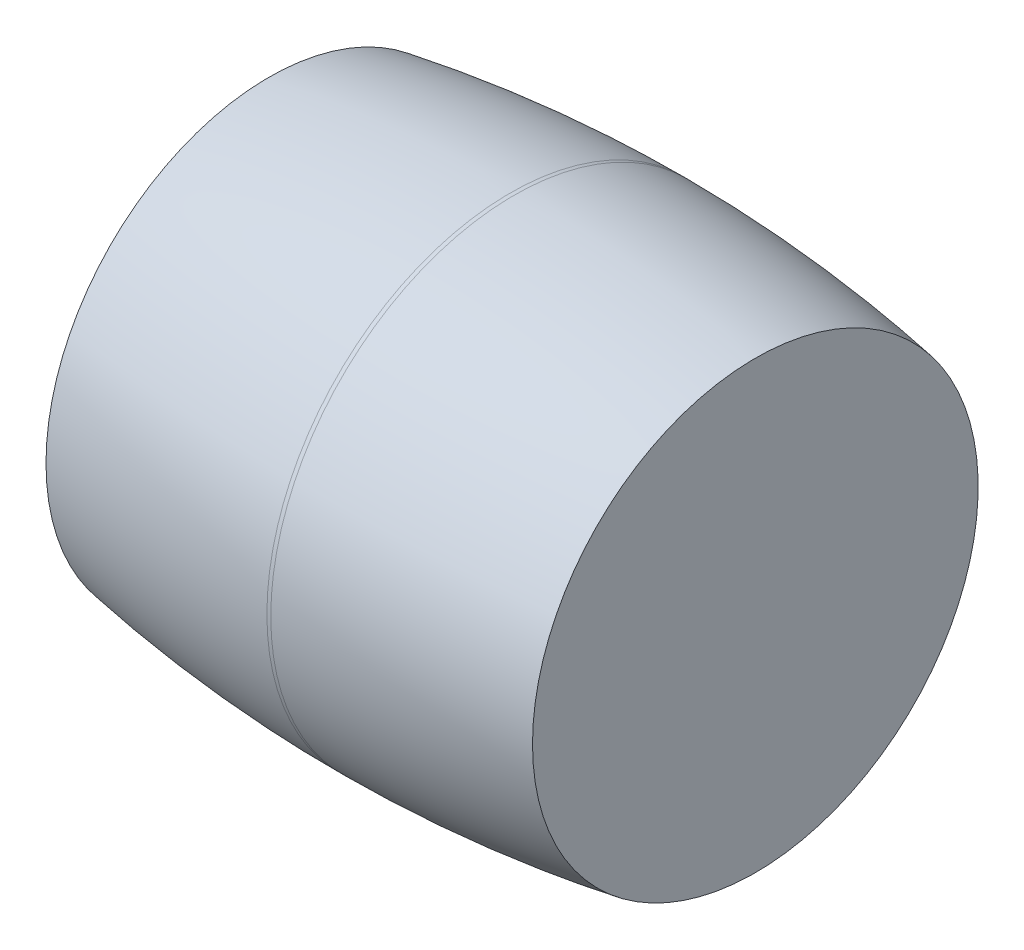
ISO-10303-21;
HEADER;
FILE_DESCRIPTION(('STEP AP214'),'2;1');
FILE_NAME('part.step','',(''),(''),'','','');
FILE_SCHEMA(('AUTOMOTIVE_DESIGN { 1 0 10303 214 1 1 1 1 }'));
ENDSEC;
DATA;
#1=APPLICATION_CONTEXT('core data for automotive mechanical design processes');
#2=APPLICATION_PROTOCOL_DEFINITION('international standard','automotive_design',2000,#1);
#3=PRODUCT_CONTEXT('',#1,'mechanical');
#4=PRODUCT('Part','Part','',(#3));
#5=PRODUCT_RELATED_PRODUCT_CATEGORY('part','',(#4));
#6=PRODUCT_DEFINITION_FORMATION('','',#4);
#7=PRODUCT_DEFINITION_CONTEXT('part definition',#1,'design');
#8=PRODUCT_DEFINITION('design','',#6,#7);
#9=PRODUCT_DEFINITION_SHAPE('','',#8);
#10=(LENGTH_UNIT() NAMED_UNIT(*) SI_UNIT(.MILLI.,.METRE.));
#11=(NAMED_UNIT(*) PLANE_ANGLE_UNIT() SI_UNIT($,.RADIAN.));
#12=(NAMED_UNIT(*) SI_UNIT($,.STERADIAN.) SOLID_ANGLE_UNIT());
#13=UNCERTAINTY_MEASURE_WITH_UNIT(LENGTH_MEASURE(1.E-05),#10,'distance_accuracy_value','');
#14=(GEOMETRIC_REPRESENTATION_CONTEXT(3) GLOBAL_UNCERTAINTY_ASSIGNED_CONTEXT((#13)) GLOBAL_UNIT_ASSIGNED_CONTEXT((#10,
#11,#12)) REPRESENTATION_CONTEXT('',''));
#15=CARTESIAN_POINT('',(0.,0.,0.));
#16=DIRECTION('',(0.,0.,1.));
#17=DIRECTION('',(1.,0.,0.));
#18=AXIS2_PLACEMENT_3D('',#15,#16,#17);
#19=CARTESIAN_POINT('',(-3.175,0.,0.));
#20=DIRECTION('',(1.,0.,0.));
#21=DIRECTION('',(0.,0.,-1.));
#22=AXIS2_PLACEMENT_3D('',#19,#20,#21);
#23=PLANE('',#22);
#24=CARTESIAN_POINT('',(-3.175,0.,0.));
#25=DIRECTION('',(-1.,0.,0.));
#26=DIRECTION('',(0.,0.,1.));
#27=AXIS2_PLACEMENT_3D('',#24,#25,#26);
#28=CIRCLE('',#27,2.90857024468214);
#29=CARTESIAN_POINT('',(-3.175,0.,2.90857024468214));
#30=VERTEX_POINT('',#29);
#31=EDGE_CURVE('E10',#30,#30,#28,.T.);
#32=ORIENTED_EDGE('',*,*,#31,.T.);
#33=EDGE_LOOP('',(#32));
#34=FACE_BOUND('',#33,.T.);
#35=ADVANCED_FACE('F29',(#34),#23,.F.);
#36=CARTESIAN_POINT('',(0.,0.,0.));
#37=DIRECTION('',(-1.,0.,0.));
#38=DIRECTION('',(0.,0.,1.));
#39=AXIS2_PLACEMENT_3D('',#36,#37,#38);
#40=DEGENERATE_TOROIDAL_SURFACE('',#39,15.8749830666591,19.05,.F.);
#41=ORIENTED_EDGE('',*,*,#31,.F.);
#42=EDGE_LOOP('',(#41));
#43=FACE_BOUND('',#42,.T.);
#44=CARTESIAN_POINT('',(-0.0254000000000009,0.,0.));
#45=DIRECTION('',(-1.,0.,0.));
#46=DIRECTION('',(0.,0.,1.));
#47=AXIS2_PLACEMENT_3D('',#44,#45,#46);
#48=CIRCLE('',#47,3.175);
#49=CARTESIAN_POINT('',(-0.0254000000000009,0.,3.175));
#50=VERTEX_POINT('',#49);
#51=EDGE_CURVE('E35',#50,#50,#48,.T.);
#52=ORIENTED_EDGE('',*,*,#51,.T.);
#53=EDGE_LOOP('',(#52));
#54=FACE_BOUND('',#53,.T.);
#55=ADVANCED_FACE('F61',(#43,#54),#40,.F.);
#56=CARTESIAN_POINT('',(0.,0.,0.));
#57=DIRECTION('',(-1.,0.,0.));
#58=DIRECTION('',(0.,0.,1.));
#59=AXIS2_PLACEMENT_3D('',#56,#57,#58);
#60=CYLINDRICAL_SURFACE('',#59,3.175);
#61=ORIENTED_EDGE('',*,*,#51,.F.);
#62=EDGE_LOOP('',(#61));
#63=FACE_BOUND('',#62,.T.);
#64=CARTESIAN_POINT('',(0.0253999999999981,0.,0.));
#65=DIRECTION('',(-1.,0.,0.));
#66=DIRECTION('',(0.,0.,1.));
#67=AXIS2_PLACEMENT_3D('',#64,#65,#66);
#68=CIRCLE('',#67,3.175);
#69=CARTESIAN_POINT('',(0.0253999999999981,0.,3.175));
#70=VERTEX_POINT('',#69);
#71=EDGE_CURVE('E39',#70,#70,#68,.T.);
#72=ORIENTED_EDGE('',*,*,#71,.T.);
#73=EDGE_LOOP('',(#72));
#74=FACE_BOUND('',#73,.T.);
#75=ADVANCED_FACE('F57',(#63,#74),#60,.T.);
#76=CARTESIAN_POINT('',(0.,0.,0.));
#77=DIRECTION('',(-1.,0.,0.));
#78=DIRECTION('',(0.,0.,1.));
#79=AXIS2_PLACEMENT_3D('',#76,#77,#78);
#80=DEGENERATE_TOROIDAL_SURFACE('',#79,15.8749830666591,19.05,.F.);
#81=ORIENTED_EDGE('',*,*,#71,.F.);
#82=EDGE_LOOP('',(#81));
#83=FACE_BOUND('',#82,.T.);
#84=CARTESIAN_POINT('',(3.175,0.,0.));
#85=DIRECTION('',(-1.,0.,0.));
#86=DIRECTION('',(0.,0.,1.));
#87=AXIS2_PLACEMENT_3D('',#84,#85,#86);
#88=CIRCLE('',#87,2.90857024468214);
#89=CARTESIAN_POINT('',(3.175,0.,2.90857024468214));
#90=VERTEX_POINT('',#89);
#91=EDGE_CURVE('E43',#90,#90,#88,.T.);
#92=ORIENTED_EDGE('',*,*,#91,.T.);
#93=EDGE_LOOP('',(#92));
#94=FACE_BOUND('',#93,.T.);
#95=ADVANCED_FACE('F49',(#83,#94),#80,.F.);
#96=CARTESIAN_POINT('',(3.175,0.,0.));
#97=DIRECTION('',(-1.,0.,0.));
#98=DIRECTION('',(0.,0.,1.));
#99=AXIS2_PLACEMENT_3D('',#96,#97,#98);
#100=PLANE('',#99);
#101=ORIENTED_EDGE('',*,*,#91,.F.);
#102=EDGE_LOOP('',(#101));
#103=FACE_BOUND('',#102,.T.);
#104=ADVANCED_FACE('F51',(#103),#100,.F.);
#105=CLOSED_SHELL('',(#35,#55,#75,#95,#104));
#106=MANIFOLD_SOLID_BREP('B2',#105);
#107=ADVANCED_BREP_SHAPE_REPRESENTATION('',(#18,#106),#14);
#108=SHAPE_DEFINITION_REPRESENTATION(#9,#107);
ENDSEC;
END-ISO-10303-21;
